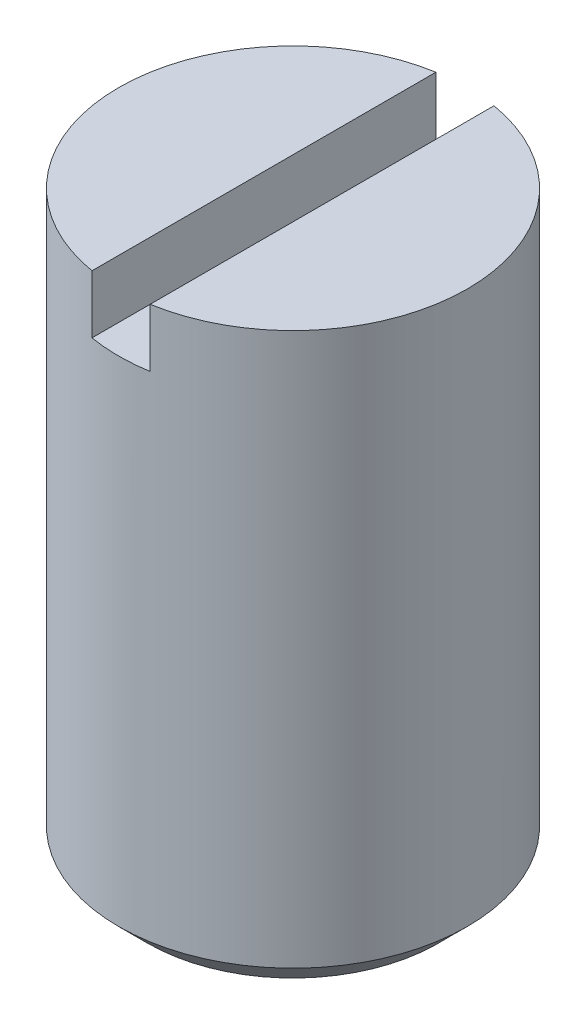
ISO-10303-21;
HEADER;
FILE_DESCRIPTION(('STEP AP214'),'2;1');
FILE_NAME('part.step','',(''),(''),'','','');
FILE_SCHEMA(('AUTOMOTIVE_DESIGN { 1 0 10303 214 1 1 1 1 }'));
ENDSEC;
DATA;
#1=APPLICATION_CONTEXT('core data for automotive mechanical design processes');
#2=APPLICATION_PROTOCOL_DEFINITION('international standard','automotive_design',2000,#1);
#3=PRODUCT_CONTEXT('',#1,'mechanical');
#4=PRODUCT('Part','Part','',(#3));
#5=PRODUCT_RELATED_PRODUCT_CATEGORY('part','',(#4));
#6=PRODUCT_DEFINITION_FORMATION('','',#4);
#7=PRODUCT_DEFINITION_CONTEXT('part definition',#1,'design');
#8=PRODUCT_DEFINITION('design','',#6,#7);
#9=PRODUCT_DEFINITION_SHAPE('','',#8);
#10=(LENGTH_UNIT() NAMED_UNIT(*) SI_UNIT(.MILLI.,.METRE.));
#11=(NAMED_UNIT(*) PLANE_ANGLE_UNIT() SI_UNIT($,.RADIAN.));
#12=(NAMED_UNIT(*) SI_UNIT($,.STERADIAN.) SOLID_ANGLE_UNIT());
#13=UNCERTAINTY_MEASURE_WITH_UNIT(LENGTH_MEASURE(1.E-05),#10,'distance_accuracy_value','');
#14=(GEOMETRIC_REPRESENTATION_CONTEXT(3) GLOBAL_UNCERTAINTY_ASSIGNED_CONTEXT((#13)) GLOBAL_UNIT_ASSIGNED_CONTEXT((#10,
#11,#12)) REPRESENTATION_CONTEXT('',''));
#15=CARTESIAN_POINT('',(0.,0.,0.));
#16=DIRECTION('',(0.,0.,1.));
#17=DIRECTION('',(1.,0.,0.));
#18=AXIS2_PLACEMENT_3D('',#15,#16,#17);
#19=CARTESIAN_POINT('',(0.,10.,0.));
#20=DIRECTION('',(0.,1.,0.));
#21=DIRECTION('',(0.,0.,1.));
#22=AXIS2_PLACEMENT_3D('',#19,#20,#21);
#23=PLANE('',#22);
#24=DIRECTION('',(0.,0.,-1.));
#25=VECTOR('',#24,1.);
#26=CARTESIAN_POINT('',(0.5,10.,0.));
#27=LINE('',#26,#25);
#28=CARTESIAN_POINT('',(0.5,10.,2.95803989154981));
#29=VERTEX_POINT('',#28);
#30=CARTESIAN_POINT('',(0.5,10.,-2.95803989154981));
#31=VERTEX_POINT('',#30);
#32=EDGE_CURVE('E77',#29,#31,#27,.T.);
#33=ORIENTED_EDGE('',*,*,#32,.F.);
#34=CARTESIAN_POINT('',(0.,10.,0.));
#35=DIRECTION('',(0.,1.,0.));
#36=DIRECTION('',(0.,0.,1.));
#37=AXIS2_PLACEMENT_3D('',#34,#35,#36);
#38=CIRCLE('',#37,3.);
#39=EDGE_CURVE('E87',#29,#31,#38,.T.);
#40=ORIENTED_EDGE('',*,*,#39,.T.);
#41=EDGE_LOOP('',(#33,#40));
#42=FACE_BOUND('',#41,.T.);
#43=ADVANCED_FACE('F31',(#42),#23,.T.);
#44=CARTESIAN_POINT('',(0.,10.,0.));
#45=DIRECTION('',(0.,-1.,0.));
#46=DIRECTION('',(0.,0.,-1.));
#47=AXIS2_PLACEMENT_3D('',#44,#45,#46);
#48=CYLINDRICAL_SURFACE('',#47,3.);
#49=ORIENTED_EDGE('',*,*,#39,.F.);
#50=DIRECTION('',(0.,-1.,0.));
#51=VECTOR('',#50,1.);
#52=CARTESIAN_POINT('',(0.5,10.,2.95803989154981));
#53=LINE('',#52,#51);
#54=CARTESIAN_POINT('',(0.5,9.,2.95803989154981));
#55=VERTEX_POINT('',#54);
#56=EDGE_CURVE('E88',#29,#55,#53,.T.);
#57=ORIENTED_EDGE('',*,*,#56,.T.);
#58=CARTESIAN_POINT('',(0.,9.,0.));
#59=DIRECTION('',(0.,-1.,0.));
#60=DIRECTION('',(0.,0.,-1.));
#61=AXIS2_PLACEMENT_3D('',#58,#59,#60);
#62=CIRCLE('',#61,3.);
#63=CARTESIAN_POINT('',(-0.5,9.,2.95803989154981));
#64=VERTEX_POINT('',#63);
#65=EDGE_CURVE('E11',#55,#64,#62,.T.);
#66=ORIENTED_EDGE('',*,*,#65,.T.);
#67=DIRECTION('',(0.,-1.,0.));
#68=VECTOR('',#67,1.);
#69=CARTESIAN_POINT('',(-0.5,10.,2.95803989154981));
#70=LINE('',#69,#68);
#71=CARTESIAN_POINT('',(-0.5,10.,2.95803989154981));
#72=VERTEX_POINT('',#71);
#73=EDGE_CURVE('E72',#64,#72,#70,.F.);
#74=ORIENTED_EDGE('',*,*,#73,.T.);
#75=CARTESIAN_POINT('',(-0.5,10.,-2.95803989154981));
#76=VERTEX_POINT('',#75);
#77=EDGE_CURVE('E82',#76,#72,#38,.T.);
#78=ORIENTED_EDGE('',*,*,#77,.F.);
#79=DIRECTION('',(0.,-1.,0.));
#80=VECTOR('',#79,1.);
#81=CARTESIAN_POINT('',(-0.5,10.,-2.95803989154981));
#82=LINE('',#81,#80);
#83=CARTESIAN_POINT('',(-0.5,9.,-2.95803989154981));
#84=VERTEX_POINT('',#83);
#85=EDGE_CURVE('E46',#76,#84,#82,.T.);
#86=ORIENTED_EDGE('',*,*,#85,.T.);
#87=CARTESIAN_POINT('',(0.5,9.,-2.95803989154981));
#88=VERTEX_POINT('',#87);
#89=EDGE_CURVE('E35',#84,#88,#62,.T.);
#90=ORIENTED_EDGE('',*,*,#89,.T.);
#91=DIRECTION('',(0.,-1.,0.));
#92=VECTOR('',#91,1.);
#93=CARTESIAN_POINT('',(0.5,10.,-2.95803989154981));
#94=LINE('',#93,#92);
#95=EDGE_CURVE('E92',#88,#31,#94,.F.);
#96=ORIENTED_EDGE('',*,*,#95,.T.);
#97=EDGE_LOOP('',(#49,#57,#66,#74,#78,#86,#90,#96));
#98=FACE_BOUND('',#97,.T.);
#99=CARTESIAN_POINT('',(0.,0.500000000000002,0.));
#100=DIRECTION('',(0.,1.,0.));
#101=DIRECTION('',(0.,0.,1.));
#102=AXIS2_PLACEMENT_3D('',#99,#100,#101);
#103=CIRCLE('',#102,3.);
#104=CARTESIAN_POINT('',(0.,0.500000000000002,3.));
#105=VERTEX_POINT('',#104);
#106=EDGE_CURVE('E91',#105,#105,#103,.T.);
#107=ORIENTED_EDGE('',*,*,#106,.T.);
#108=EDGE_LOOP('',(#107));
#109=FACE_BOUND('',#108,.T.);
#110=ADVANCED_FACE('F33',(#98,#109),#48,.T.);
#111=DIRECTION('',(0.,0.,1.));
#112=VECTOR('',#111,1.);
#113=CARTESIAN_POINT('',(-0.5,10.,0.));
#114=LINE('',#113,#112);
#115=EDGE_CURVE('E69',#76,#72,#114,.T.);
#116=ORIENTED_EDGE('',*,*,#115,.F.);
#117=ORIENTED_EDGE('',*,*,#77,.T.);
#118=EDGE_LOOP('',(#116,#117));
#119=FACE_BOUND('',#118,.T.);
#120=ADVANCED_FACE('F86',(#119),#23,.T.);
#121=CARTESIAN_POINT('',(0.,0.,0.));
#122=DIRECTION('',(0.,1.,0.));
#123=DIRECTION('',(0.,0.,1.));
#124=AXIS2_PLACEMENT_3D('',#121,#122,#123);
#125=PLANE('',#124);
#126=CARTESIAN_POINT('',(0.,0.,0.));
#127=DIRECTION('',(0.,1.,0.));
#128=DIRECTION('',(0.,0.,1.));
#129=AXIS2_PLACEMENT_3D('',#126,#127,#128);
#130=CIRCLE('',#129,2.49999999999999);
#131=CARTESIAN_POINT('',(0.,0.,2.49999999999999));
#132=VERTEX_POINT('',#131);
#133=EDGE_CURVE('E78',#132,#132,#130,.F.);
#134=ORIENTED_EDGE('',*,*,#133,.T.);
#135=EDGE_LOOP('',(#134));
#136=FACE_BOUND('',#135,.T.);
#137=ADVANCED_FACE('F111',(#136),#125,.F.);
#138=CARTESIAN_POINT('',(0.,0.500000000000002,0.));
#139=DIRECTION('',(0.,1.,0.));
#140=DIRECTION('',(0.,0.,1.));
#141=AXIS2_PLACEMENT_3D('',#138,#139,#140);
#142=CONICAL_SURFACE('',#141,3.,0.785398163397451);
#143=ORIENTED_EDGE('',*,*,#133,.F.);
#144=EDGE_LOOP('',(#143));
#145=FACE_BOUND('',#144,.T.);
#146=ORIENTED_EDGE('',*,*,#106,.F.);
#147=EDGE_LOOP('',(#146));
#148=FACE_BOUND('',#147,.T.);
#149=ADVANCED_FACE('F115',(#145,#148),#142,.T.);
#150=CARTESIAN_POINT('',(0.5,9.,-3.));
#151=DIRECTION('',(0.,-1.,0.));
#152=DIRECTION('',(0.,0.,-1.));
#153=AXIS2_PLACEMENT_3D('',#150,#151,#152);
#154=PLANE('',#153);
#155=DIRECTION('',(0.,0.,-1.));
#156=VECTOR('',#155,1.);
#157=CARTESIAN_POINT('',(0.5,9.,-3.));
#158=LINE('',#157,#156);
#159=EDGE_CURVE('E84',#55,#88,#158,.T.);
#160=ORIENTED_EDGE('',*,*,#159,.T.);
#161=ORIENTED_EDGE('',*,*,#89,.F.);
#162=DIRECTION('',(0.,0.,1.));
#163=VECTOR('',#162,1.);
#164=CARTESIAN_POINT('',(-0.5,9.,-3.));
#165=LINE('',#164,#163);
#166=EDGE_CURVE('E132',#84,#64,#165,.T.);
#167=ORIENTED_EDGE('',*,*,#166,.T.);
#168=ORIENTED_EDGE('',*,*,#65,.F.);
#169=EDGE_LOOP('',(#160,#161,#167,#168));
#170=FACE_BOUND('',#169,.T.);
#171=ADVANCED_FACE('F120',(#170),#154,.F.);
#172=CARTESIAN_POINT('',(0.5,9.,-3.));
#173=DIRECTION('',(1.,0.,0.));
#174=DIRECTION('',(0.,0.,-1.));
#175=AXIS2_PLACEMENT_3D('',#172,#173,#174);
#176=PLANE('',#175);
#177=ORIENTED_EDGE('',*,*,#32,.T.);
#178=ORIENTED_EDGE('',*,*,#95,.F.);
#179=ORIENTED_EDGE('',*,*,#159,.F.);
#180=ORIENTED_EDGE('',*,*,#56,.F.);
#181=EDGE_LOOP('',(#177,#178,#179,#180));
#182=FACE_BOUND('',#181,.T.);
#183=ADVANCED_FACE('F101',(#182),#176,.F.);
#184=CARTESIAN_POINT('',(-0.5,9.,-3.));
#185=DIRECTION('',(-1.,0.,0.));
#186=DIRECTION('',(0.,0.,1.));
#187=AXIS2_PLACEMENT_3D('',#184,#185,#186);
#188=PLANE('',#187);
#189=ORIENTED_EDGE('',*,*,#115,.T.);
#190=ORIENTED_EDGE('',*,*,#73,.F.);
#191=ORIENTED_EDGE('',*,*,#166,.F.);
#192=ORIENTED_EDGE('',*,*,#85,.F.);
#193=EDGE_LOOP('',(#189,#190,#191,#192));
#194=FACE_BOUND('',#193,.T.);
#195=ADVANCED_FACE('F71',(#194),#188,.F.);
#196=CLOSED_SHELL('',(#43,#110,#120,#137,#149,#171,#183,#195));
#197=MANIFOLD_SOLID_BREP('B2',#196);
#198=ADVANCED_BREP_SHAPE_REPRESENTATION('',(#18,#197),#14);
#199=SHAPE_DEFINITION_REPRESENTATION(#9,#198);
ENDSEC;
END-ISO-10303-21;
